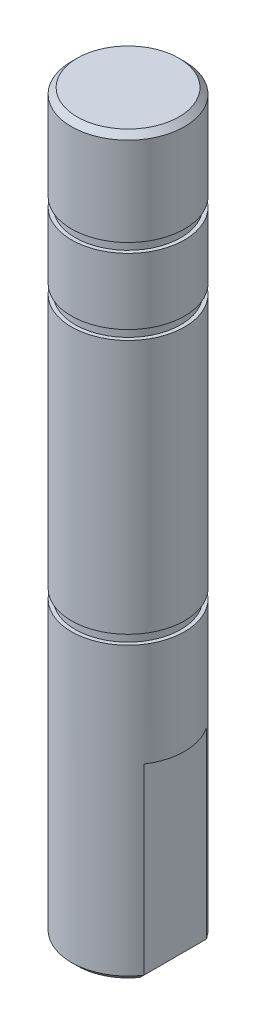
ISO-10303-21;
HEADER;
FILE_DESCRIPTION(('STEP AP214'),'2;1');
FILE_NAME('part.step','',(''),(''),'','','');
FILE_SCHEMA(('AUTOMOTIVE_DESIGN { 1 0 10303 214 1 1 1 1 }'));
ENDSEC;
DATA;
#1=APPLICATION_CONTEXT('core data for automotive mechanical design processes');
#2=APPLICATION_PROTOCOL_DEFINITION('international standard','automotive_design',2000,#1);
#3=PRODUCT_CONTEXT('',#1,'mechanical');
#4=PRODUCT('Part','Part','',(#3));
#5=PRODUCT_RELATED_PRODUCT_CATEGORY('part','',(#4));
#6=PRODUCT_DEFINITION_FORMATION('','',#4);
#7=PRODUCT_DEFINITION_CONTEXT('part definition',#1,'design');
#8=PRODUCT_DEFINITION('design','',#6,#7);
#9=PRODUCT_DEFINITION_SHAPE('','',#8);
#10=(LENGTH_UNIT() NAMED_UNIT(*) SI_UNIT(.MILLI.,.METRE.));
#11=(NAMED_UNIT(*) PLANE_ANGLE_UNIT() SI_UNIT($,.RADIAN.));
#12=(NAMED_UNIT(*) SI_UNIT($,.STERADIAN.) SOLID_ANGLE_UNIT());
#13=UNCERTAINTY_MEASURE_WITH_UNIT(LENGTH_MEASURE(1.E-05),#10,'distance_accuracy_value','');
#14=(GEOMETRIC_REPRESENTATION_CONTEXT(3) GLOBAL_UNCERTAINTY_ASSIGNED_CONTEXT((#13)) GLOBAL_UNIT_ASSIGNED_CONTEXT((#10,
#11,#12)) REPRESENTATION_CONTEXT('',''));
#15=CARTESIAN_POINT('',(0.,0.,0.));
#16=DIRECTION('',(0.,0.,1.));
#17=DIRECTION('',(1.,0.,0.));
#18=AXIS2_PLACEMENT_3D('',#15,#16,#17);
#19=CARTESIAN_POINT('',(0.,39.,0.));
#20=DIRECTION('',(0.,1.,0.));
#21=DIRECTION('',(0.,0.,1.));
#22=AXIS2_PLACEMENT_3D('',#19,#20,#21);
#23=PLANE('',#22);
#24=CARTESIAN_POINT('',(0.,39.0000000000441,0.));
#25=DIRECTION('',(0.,-1.,0.));
#26=DIRECTION('',(0.,0.,-1.));
#27=AXIS2_PLACEMENT_3D('',#24,#25,#26);
#28=CIRCLE('',#27,2.70000000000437);
#29=CARTESIAN_POINT('',(0.,39.0000000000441,-2.70000000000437));
#30=VERTEX_POINT('',#29);
#31=EDGE_CURVE('E20',#30,#30,#28,.T.);
#32=ORIENTED_EDGE('',*,*,#31,.F.);
#33=EDGE_LOOP('',(#32));
#34=FACE_BOUND('',#33,.T.);
#35=ADVANCED_FACE('F17',(#34),#23,.T.);
#36=CARTESIAN_POINT('',(0.,38.7000000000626,0.));
#37=DIRECTION('',(0.,-1.,0.));
#38=DIRECTION('',(0.,0.,-1.));
#39=AXIS2_PLACEMENT_3D('',#36,#37,#38);
#40=CONICAL_SURFACE('',#39,2.9999999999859,0.785398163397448);
#41=ORIENTED_EDGE('',*,*,#31,.T.);
#42=EDGE_LOOP('',(#41));
#43=FACE_BOUND('',#42,.T.);
#44=CARTESIAN_POINT('',(0.,38.7,0.));
#45=DIRECTION('',(0.,-1.,0.));
#46=DIRECTION('',(0.,0.,-1.));
#47=AXIS2_PLACEMENT_3D('',#44,#45,#46);
#48=CIRCLE('',#47,3.);
#49=CARTESIAN_POINT('',(0.,38.7,-3.));
#50=VERTEX_POINT('',#49);
#51=EDGE_CURVE('E81',#50,#50,#48,.T.);
#52=ORIENTED_EDGE('',*,*,#51,.F.);
#53=EDGE_LOOP('',(#52));
#54=FACE_BOUND('',#53,.T.);
#55=ADVANCED_FACE('F275',(#43,#54),#40,.T.);
#56=CARTESIAN_POINT('',(0.,39.,0.));
#57=DIRECTION('',(0.,-1.,0.));
#58=DIRECTION('',(0.,0.,-1.));
#59=AXIS2_PLACEMENT_3D('',#56,#57,#58);
#60=CYLINDRICAL_SURFACE('',#59,3.);
#61=ORIENTED_EDGE('',*,*,#51,.T.);
#62=EDGE_LOOP('',(#61));
#63=FACE_BOUND('',#62,.T.);
#64=CARTESIAN_POINT('',(0.,34.,0.));
#65=DIRECTION('',(0.,-1.,0.));
#66=DIRECTION('',(0.,0.,-1.));
#67=AXIS2_PLACEMENT_3D('',#64,#65,#66);
#68=CIRCLE('',#67,3.);
#69=CARTESIAN_POINT('',(0.,34.,-3.));
#70=VERTEX_POINT('',#69);
#71=EDGE_CURVE('E84',#70,#70,#68,.F.);
#72=ORIENTED_EDGE('',*,*,#71,.T.);
#73=EDGE_LOOP('',(#72));
#74=FACE_BOUND('',#73,.T.);
#75=ADVANCED_FACE('F265',(#63,#74),#60,.T.);
#76=CARTESIAN_POINT('',(-3.,34.,0.));
#77=DIRECTION('',(0.,1.,0.));
#78=DIRECTION('',(0.,0.,1.));
#79=AXIS2_PLACEMENT_3D('',#76,#77,#78);
#80=PLANE('',#79);
#81=CARTESIAN_POINT('',(0.,34.,0.));
#82=DIRECTION('',(0.,1.,0.));
#83=DIRECTION('',(0.,0.,1.));
#84=AXIS2_PLACEMENT_3D('',#81,#82,#83);
#85=CIRCLE('',#84,2.8);
#86=CARTESIAN_POINT('',(0.,34.,2.8));
#87=VERTEX_POINT('',#86);
#88=EDGE_CURVE('E333',#87,#87,#85,.F.);
#89=ORIENTED_EDGE('',*,*,#88,.F.);
#90=EDGE_LOOP('',(#89));
#91=FACE_BOUND('',#90,.T.);
#92=ORIENTED_EDGE('',*,*,#71,.F.);
#93=EDGE_LOOP('',(#92));
#94=FACE_BOUND('',#93,.T.);
#95=ADVANCED_FACE('F255',(#91,#94),#80,.F.);
#96=CARTESIAN_POINT('',(0.,39.,0.));
#97=DIRECTION('',(0.,1.,0.));
#98=DIRECTION('',(0.,0.,1.));
#99=AXIS2_PLACEMENT_3D('',#96,#97,#98);
#100=CYLINDRICAL_SURFACE('',#99,2.8);
#101=ORIENTED_EDGE('',*,*,#88,.T.);
#102=EDGE_LOOP('',(#101));
#103=FACE_BOUND('',#102,.T.);
#104=CARTESIAN_POINT('',(0.,33.5,0.));
#105=DIRECTION('',(0.,1.,0.));
#106=DIRECTION('',(0.,0.,1.));
#107=AXIS2_PLACEMENT_3D('',#104,#105,#106);
#108=CIRCLE('',#107,2.8);
#109=CARTESIAN_POINT('',(0.,33.5,2.8));
#110=VERTEX_POINT('',#109);
#111=EDGE_CURVE('E335',#110,#110,#108,.T.);
#112=ORIENTED_EDGE('',*,*,#111,.T.);
#113=EDGE_LOOP('',(#112));
#114=FACE_BOUND('',#113,.T.);
#115=ADVANCED_FACE('F245',(#103,#114),#100,.T.);
#116=CARTESIAN_POINT('',(-3.,33.5,0.));
#117=DIRECTION('',(0.,-1.,0.));
#118=DIRECTION('',(0.,0.,-1.));
#119=AXIS2_PLACEMENT_3D('',#116,#117,#118);
#120=PLANE('',#119);
#121=CARTESIAN_POINT('',(0.,33.5,0.));
#122=DIRECTION('',(0.,-1.,0.));
#123=DIRECTION('',(0.,0.,-1.));
#124=AXIS2_PLACEMENT_3D('',#121,#122,#123);
#125=CIRCLE('',#124,3.);
#126=CARTESIAN_POINT('',(0.,33.5,-3.));
#127=VERTEX_POINT('',#126);
#128=EDGE_CURVE('E340',#127,#127,#125,.T.);
#129=ORIENTED_EDGE('',*,*,#128,.F.);
#130=EDGE_LOOP('',(#129));
#131=FACE_BOUND('',#130,.T.);
#132=ORIENTED_EDGE('',*,*,#111,.F.);
#133=EDGE_LOOP('',(#132));
#134=FACE_BOUND('',#133,.T.);
#135=ADVANCED_FACE('F235',(#131,#134),#120,.F.);
#136=CARTESIAN_POINT('',(0.,39.,0.));
#137=DIRECTION('',(0.,-1.,0.));
#138=DIRECTION('',(0.,0.,-1.));
#139=AXIS2_PLACEMENT_3D('',#136,#137,#138);
#140=CYLINDRICAL_SURFACE('',#139,3.);
#141=ORIENTED_EDGE('',*,*,#128,.T.);
#142=EDGE_LOOP('',(#141));
#143=FACE_BOUND('',#142,.T.);
#144=CARTESIAN_POINT('',(0.,30.,0.));
#145=DIRECTION('',(0.,-1.,0.));
#146=DIRECTION('',(0.,0.,-1.));
#147=AXIS2_PLACEMENT_3D('',#144,#145,#146);
#148=CIRCLE('',#147,3.);
#149=CARTESIAN_POINT('',(0.,30.,-3.));
#150=VERTEX_POINT('',#149);
#151=EDGE_CURVE('E343',#150,#150,#148,.F.);
#152=ORIENTED_EDGE('',*,*,#151,.T.);
#153=EDGE_LOOP('',(#152));
#154=FACE_BOUND('',#153,.T.);
#155=ADVANCED_FACE('F225',(#143,#154),#140,.T.);
#156=CARTESIAN_POINT('',(-3.,30.,0.));
#157=DIRECTION('',(0.,1.,0.));
#158=DIRECTION('',(0.,0.,1.));
#159=AXIS2_PLACEMENT_3D('',#156,#157,#158);
#160=PLANE('',#159);
#161=CARTESIAN_POINT('',(0.,30.,0.));
#162=DIRECTION('',(0.,1.,0.));
#163=DIRECTION('',(0.,0.,1.));
#164=AXIS2_PLACEMENT_3D('',#161,#162,#163);
#165=CIRCLE('',#164,2.8);
#166=CARTESIAN_POINT('',(0.,30.,2.8));
#167=VERTEX_POINT('',#166);
#168=EDGE_CURVE('E346',#167,#167,#165,.F.);
#169=ORIENTED_EDGE('',*,*,#168,.F.);
#170=EDGE_LOOP('',(#169));
#171=FACE_BOUND('',#170,.T.);
#172=ORIENTED_EDGE('',*,*,#151,.F.);
#173=EDGE_LOOP('',(#172));
#174=FACE_BOUND('',#173,.T.);
#175=ADVANCED_FACE('F215',(#171,#174),#160,.F.);
#176=CARTESIAN_POINT('',(0.,39.,0.));
#177=DIRECTION('',(0.,1.,0.));
#178=DIRECTION('',(0.,0.,1.));
#179=AXIS2_PLACEMENT_3D('',#176,#177,#178);
#180=CYLINDRICAL_SURFACE('',#179,2.8);
#181=ORIENTED_EDGE('',*,*,#168,.T.);
#182=EDGE_LOOP('',(#181));
#183=FACE_BOUND('',#182,.T.);
#184=CARTESIAN_POINT('',(0.,29.5,0.));
#185=DIRECTION('',(0.,1.,0.));
#186=DIRECTION('',(0.,0.,1.));
#187=AXIS2_PLACEMENT_3D('',#184,#185,#186);
#188=CIRCLE('',#187,2.8);
#189=CARTESIAN_POINT('',(0.,29.5,2.8));
#190=VERTEX_POINT('',#189);
#191=EDGE_CURVE('E349',#190,#190,#188,.T.);
#192=ORIENTED_EDGE('',*,*,#191,.T.);
#193=EDGE_LOOP('',(#192));
#194=FACE_BOUND('',#193,.T.);
#195=ADVANCED_FACE('F205',(#183,#194),#180,.T.);
#196=CARTESIAN_POINT('',(-3.,29.5,0.));
#197=DIRECTION('',(0.,-1.,0.));
#198=DIRECTION('',(0.,0.,-1.));
#199=AXIS2_PLACEMENT_3D('',#196,#197,#198);
#200=PLANE('',#199);
#201=CARTESIAN_POINT('',(0.,29.5,0.));
#202=DIRECTION('',(0.,-1.,0.));
#203=DIRECTION('',(0.,0.,-1.));
#204=AXIS2_PLACEMENT_3D('',#201,#202,#203);
#205=CIRCLE('',#204,3.);
#206=CARTESIAN_POINT('',(0.,29.5,-3.));
#207=VERTEX_POINT('',#206);
#208=EDGE_CURVE('E352',#207,#207,#205,.T.);
#209=ORIENTED_EDGE('',*,*,#208,.F.);
#210=EDGE_LOOP('',(#209));
#211=FACE_BOUND('',#210,.T.);
#212=ORIENTED_EDGE('',*,*,#191,.F.);
#213=EDGE_LOOP('',(#212));
#214=FACE_BOUND('',#213,.T.);
#215=ADVANCED_FACE('F194',(#211,#214),#200,.F.);
#216=CARTESIAN_POINT('',(0.,39.,0.));
#217=DIRECTION('',(0.,-1.,0.));
#218=DIRECTION('',(0.,0.,-1.));
#219=AXIS2_PLACEMENT_3D('',#216,#217,#218);
#220=CYLINDRICAL_SURFACE('',#219,3.);
#221=ORIENTED_EDGE('',*,*,#208,.T.);
#222=EDGE_LOOP('',(#221));
#223=FACE_BOUND('',#222,.T.);
#224=CARTESIAN_POINT('',(0.,16.,0.));
#225=DIRECTION('',(0.,-1.,0.));
#226=DIRECTION('',(0.,0.,-1.));
#227=AXIS2_PLACEMENT_3D('',#224,#225,#226);
#228=CIRCLE('',#227,3.);
#229=CARTESIAN_POINT('',(0.,16.,-3.));
#230=VERTEX_POINT('',#229);
#231=EDGE_CURVE('E355',#230,#230,#228,.F.);
#232=ORIENTED_EDGE('',*,*,#231,.T.);
#233=EDGE_LOOP('',(#232));
#234=FACE_BOUND('',#233,.T.);
#235=ADVANCED_FACE('F184',(#223,#234),#220,.T.);
#236=CARTESIAN_POINT('',(-3.,16.,0.));
#237=DIRECTION('',(0.,1.,0.));
#238=DIRECTION('',(0.,0.,1.));
#239=AXIS2_PLACEMENT_3D('',#236,#237,#238);
#240=PLANE('',#239);
#241=CARTESIAN_POINT('',(0.,16.,0.));
#242=DIRECTION('',(0.,1.,0.));
#243=DIRECTION('',(0.,0.,1.));
#244=AXIS2_PLACEMENT_3D('',#241,#242,#243);
#245=CIRCLE('',#244,2.8);
#246=CARTESIAN_POINT('',(0.,16.,2.8));
#247=VERTEX_POINT('',#246);
#248=EDGE_CURVE('E62',#247,#247,#245,.F.);
#249=ORIENTED_EDGE('',*,*,#248,.F.);
#250=EDGE_LOOP('',(#249));
#251=FACE_BOUND('',#250,.T.);
#252=ORIENTED_EDGE('',*,*,#231,.F.);
#253=EDGE_LOOP('',(#252));
#254=FACE_BOUND('',#253,.T.);
#255=ADVANCED_FACE('F126',(#251,#254),#240,.F.);
#256=CARTESIAN_POINT('',(2.2,0.,0.));
#257=DIRECTION('',(-0.707106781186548,0.707106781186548,0.));
#258=DIRECTION('',(-0.707106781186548,-0.707106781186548,0.));
#259=AXIS2_PLACEMENT_3D('',#256,#257,#258);
#260=PLANE('',#259);
#261=DIRECTION('',(0.,0.,1.));
#262=VECTOR('',#261,1.);
#263=CARTESIAN_POINT('',(2.5,0.300000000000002,-3.));
#264=LINE('',#263,#262);
#265=CARTESIAN_POINT('',(2.49999999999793,0.299999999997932,-1.65831239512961));
#266=VERTEX_POINT('',#265);
#267=CARTESIAN_POINT('',(2.49999999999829,0.299999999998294,1.65831239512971));
#268=VERTEX_POINT('',#267);
#269=EDGE_CURVE('E60',#266,#268,#264,.T.);
#270=ORIENTED_EDGE('',*,*,#269,.T.);
#271=CARTESIAN_POINT('',(2.20000000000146,-4.29691004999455E-12,1.56524758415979));
#272=CARTESIAN_POINT('',(2.24993376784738,0.0499337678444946,1.58118555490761));
#273=CARTESIAN_POINT('',(2.29990066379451,0.0999006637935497,1.59690994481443));
#274=CARTESIAN_POINT('',(2.3999006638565,0.199900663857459,1.62793154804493));
#275=CARTESIAN_POINT('',(2.4499337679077,0.249933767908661,1.64322876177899));
#276=CARTESIAN_POINT('',(2.49999999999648,0.299999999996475,1.65831239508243));
#277=B_SPLINE_CURVE_WITH_KNOTS('',3,(#271,#272,#273,#274,#275,#276),.UNSPECIFIED.,.F.,.F.,(4,2,
4),(0.,0.21717674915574,0.434353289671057),.UNSPECIFIED.);
#278=CARTESIAN_POINT('',(2.19999999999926,-6.38860493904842E-13,1.56524758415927));
#279=VERTEX_POINT('',#278);
#280=EDGE_CURVE('E47',#279,#268,#277,.T.);
#281=ORIENTED_EDGE('',*,*,#280,.F.);
#282=DIRECTION('',(0.,0.,1.));
#283=VECTOR('',#282,1.);
#284=CARTESIAN_POINT('',(2.19999999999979,0.,0.));
#285=LINE('',#284,#283);
#286=CARTESIAN_POINT('',(2.19999999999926,-6.3871969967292E-13,-1.56524758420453));
#287=VERTEX_POINT('',#286);
#288=EDGE_CURVE('E58',#279,#287,#285,.F.);
#289=ORIENTED_EDGE('',*,*,#288,.T.);
#290=CARTESIAN_POINT('',(2.49999999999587,0.299999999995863,-1.65831239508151));
#291=CARTESIAN_POINT('',(2.44993376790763,0.249933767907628,-1.64322876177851));
#292=CARTESIAN_POINT('',(2.39990066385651,0.19990066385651,-1.62793154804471));
#293=CARTESIAN_POINT('',(2.29990066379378,0.0999006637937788,-1.59690994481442));
#294=CARTESIAN_POINT('',(2.24993376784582,0.049933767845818,-1.58118555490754));
#295=CARTESIAN_POINT('',(2.19999999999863,-1.37406796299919E-12,-1.56524758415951));
#296=B_SPLINE_CURVE_WITH_KNOTS('',3,(#290,#291,#292,#293,#294,#295),.UNSPECIFIED.,.F.,.F.,(4,2,
4),(0.,0.217176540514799,0.434353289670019),.UNSPECIFIED.);
#297=EDGE_CURVE('E49',#266,#287,#296,.T.);
#298=ORIENTED_EDGE('',*,*,#297,.F.);
#299=EDGE_LOOP('',(#270,#281,#289,#298));
#300=FACE_BOUND('',#299,.T.);
#301=ADVANCED_FACE('F57',(#300),#260,.F.);
#302=CARTESIAN_POINT('',(0.,39.,0.));
#303=DIRECTION('',(0.,1.,0.));
#304=DIRECTION('',(0.,0.,1.));
#305=AXIS2_PLACEMENT_3D('',#302,#303,#304);
#306=CYLINDRICAL_SURFACE('',#305,2.8);
#307=ORIENTED_EDGE('',*,*,#248,.T.);
#308=EDGE_LOOP('',(#307));
#309=FACE_BOUND('',#308,.T.);
#310=CARTESIAN_POINT('',(0.,15.5,0.));
#311=DIRECTION('',(0.,1.,0.));
#312=DIRECTION('',(0.,0.,1.));
#313=AXIS2_PLACEMENT_3D('',#310,#311,#312);
#314=CIRCLE('',#313,2.8);
#315=CARTESIAN_POINT('',(0.,15.5,2.8));
#316=VERTEX_POINT('',#315);
#317=EDGE_CURVE('E65',#316,#316,#314,.T.);
#318=ORIENTED_EDGE('',*,*,#317,.T.);
#319=EDGE_LOOP('',(#318));
#320=FACE_BOUND('',#319,.T.);
#321=ADVANCED_FACE('F118',(#309,#320),#306,.T.);
#322=CARTESIAN_POINT('',(3.,10.,-3.));
#323=DIRECTION('',(0.,1.,0.));
#324=DIRECTION('',(0.,0.,1.));
#325=AXIS2_PLACEMENT_3D('',#322,#323,#324);
#326=PLANE('',#325);
#327=CARTESIAN_POINT('',(0.,10.,0.));
#328=DIRECTION('',(0.,-1.,0.));
#329=DIRECTION('',(0.,0.,-1.));
#330=AXIS2_PLACEMENT_3D('',#327,#328,#329);
#331=CIRCLE('',#330,3.);
#332=CARTESIAN_POINT('',(2.5,10.,1.6583123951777));
#333=VERTEX_POINT('',#332);
#334=CARTESIAN_POINT('',(2.5,10.,-1.6583123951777));
#335=VERTEX_POINT('',#334);
#336=EDGE_CURVE('E76',#333,#335,#331,.F.);
#337=ORIENTED_EDGE('',*,*,#336,.F.);
#338=DIRECTION('',(0.,0.,1.));
#339=VECTOR('',#338,1.);
#340=CARTESIAN_POINT('',(2.5,10.,-3.));
#341=LINE('',#340,#339);
#342=EDGE_CURVE('E61',#333,#335,#341,.F.);
#343=ORIENTED_EDGE('',*,*,#342,.T.);
#344=EDGE_LOOP('',(#337,#343));
#345=FACE_BOUND('',#344,.T.);
#346=ADVANCED_FACE('F115',(#345),#326,.F.);
#347=CARTESIAN_POINT('',(2.5,0.,-3.));
#348=DIRECTION('',(-1.,0.,0.));
#349=DIRECTION('',(0.,0.,1.));
#350=AXIS2_PLACEMENT_3D('',#347,#348,#349);
#351=PLANE('',#350);
#352=ORIENTED_EDGE('',*,*,#269,.F.);
#353=DIRECTION('',(0.,-1.,0.));
#354=VECTOR('',#353,1.);
#355=CARTESIAN_POINT('',(2.5,39.,-1.6583123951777));
#356=LINE('',#355,#354);
#357=EDGE_CURVE('E53',#335,#266,#356,.T.);
#358=ORIENTED_EDGE('',*,*,#357,.F.);
#359=ORIENTED_EDGE('',*,*,#342,.F.);
#360=DIRECTION('',(0.,-1.,0.));
#361=VECTOR('',#360,1.);
#362=CARTESIAN_POINT('',(2.5,39.,1.6583123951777));
#363=LINE('',#362,#361);
#364=EDGE_CURVE('E68',#268,#333,#363,.F.);
#365=ORIENTED_EDGE('',*,*,#364,.F.);
#366=EDGE_LOOP('',(#352,#358,#359,#365));
#367=FACE_BOUND('',#366,.T.);
#368=ADVANCED_FACE('F112',(#367),#351,.F.);
#369=CARTESIAN_POINT('',(0.,0.,0.));
#370=DIRECTION('',(0.,1.,0.));
#371=DIRECTION('',(0.,0.,1.));
#372=AXIS2_PLACEMENT_3D('',#369,#370,#371);
#373=PLANE('',#372);
#374=CARTESIAN_POINT('',(0.,0.,0.));
#375=DIRECTION('',(0.,1.,0.));
#376=DIRECTION('',(0.,0.,1.));
#377=AXIS2_PLACEMENT_3D('',#374,#375,#376);
#378=CIRCLE('',#377,2.69999999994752);
#379=EDGE_CURVE('E44',#287,#279,#378,.T.);
#380=ORIENTED_EDGE('',*,*,#379,.F.);
#381=ORIENTED_EDGE('',*,*,#288,.F.);
#382=EDGE_LOOP('',(#380,#381));
#383=FACE_BOUND('',#382,.T.);
#384=ADVANCED_FACE('F64',(#383),#373,.F.);
#385=CARTESIAN_POINT('',(-3.,15.5,0.));
#386=DIRECTION('',(0.,-1.,0.));
#387=DIRECTION('',(0.,0.,-1.));
#388=AXIS2_PLACEMENT_3D('',#385,#386,#387);
#389=PLANE('',#388);
#390=CARTESIAN_POINT('',(0.,15.5,0.));
#391=DIRECTION('',(0.,-1.,0.));
#392=DIRECTION('',(0.,0.,-1.));
#393=AXIS2_PLACEMENT_3D('',#390,#391,#392);
#394=CIRCLE('',#393,3.);
#395=CARTESIAN_POINT('',(0.,15.5,-3.));
#396=VERTEX_POINT('',#395);
#397=EDGE_CURVE('E26',#396,#396,#394,.T.);
#398=ORIENTED_EDGE('',*,*,#397,.F.);
#399=EDGE_LOOP('',(#398));
#400=FACE_BOUND('',#399,.T.);
#401=ORIENTED_EDGE('',*,*,#317,.F.);
#402=EDGE_LOOP('',(#401));
#403=FACE_BOUND('',#402,.T.);
#404=ADVANCED_FACE('F105',(#400,#403),#389,.F.);
#405=CARTESIAN_POINT('',(0.,0.299999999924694,0.));
#406=DIRECTION('',(0.,1.,0.));
#407=DIRECTION('',(0.,0.,1.));
#408=AXIS2_PLACEMENT_3D('',#405,#406,#407);
#409=CONICAL_SURFACE('',#408,2.99999999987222,0.785398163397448);
#410=ORIENTED_EDGE('',*,*,#379,.T.);
#411=ORIENTED_EDGE('',*,*,#280,.T.);
#412=CARTESIAN_POINT('',(0.,0.300000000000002,0.));
#413=DIRECTION('',(0.,-1.,0.));
#414=DIRECTION('',(0.,0.,-1.));
#415=AXIS2_PLACEMENT_3D('',#412,#413,#414);
#416=CIRCLE('',#415,3.);
#417=EDGE_CURVE('E11',#266,#268,#416,.F.);
#418=ORIENTED_EDGE('',*,*,#417,.F.);
#419=ORIENTED_EDGE('',*,*,#297,.T.);
#420=EDGE_LOOP('',(#410,#411,#418,#419));
#421=FACE_BOUND('',#420,.T.);
#422=ADVANCED_FACE('F46',(#421),#409,.T.);
#423=CARTESIAN_POINT('',(0.,39.,0.));
#424=DIRECTION('',(0.,-1.,0.));
#425=DIRECTION('',(0.,0.,-1.));
#426=AXIS2_PLACEMENT_3D('',#423,#424,#425);
#427=CYLINDRICAL_SURFACE('',#426,3.);
#428=ORIENTED_EDGE('',*,*,#397,.T.);
#429=EDGE_LOOP('',(#428));
#430=FACE_BOUND('',#429,.T.);
#431=ORIENTED_EDGE('',*,*,#417,.T.);
#432=ORIENTED_EDGE('',*,*,#364,.T.);
#433=ORIENTED_EDGE('',*,*,#336,.T.);
#434=ORIENTED_EDGE('',*,*,#357,.T.);
#435=EDGE_LOOP('',(#431,#432,#433,#434));
#436=FACE_BOUND('',#435,.T.);
#437=ADVANCED_FACE('F104',(#430,#436),#427,.T.);
#438=CLOSED_SHELL('',(#35,#55,#75,#95,#115,#135,#155,#175,#195,#215,#235,#255,#301,#321,#346,
#368,#384,#404,#422,#437));
#439=MANIFOLD_SOLID_BREP('B1',#438);
#440=ADVANCED_BREP_SHAPE_REPRESENTATION('',(#18,#439),#14);
#441=SHAPE_DEFINITION_REPRESENTATION(#9,#440);
ENDSEC;
END-ISO-10303-21;
